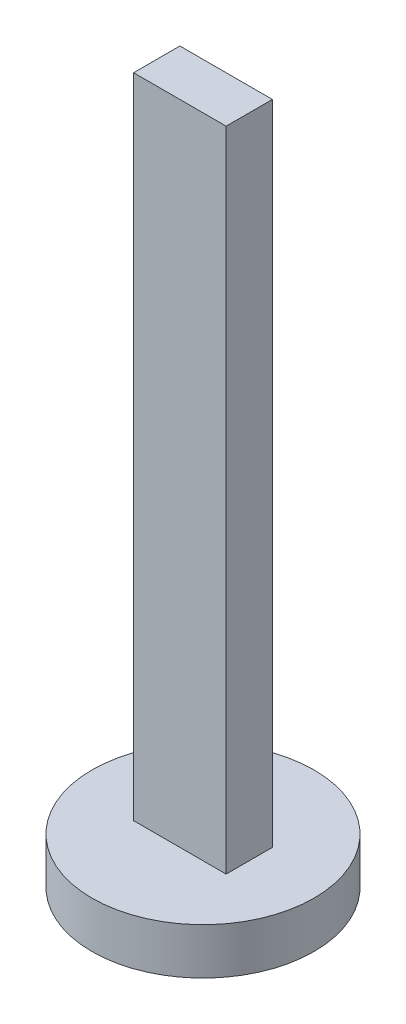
from build123d import *

# Parameters (mm, degrees)
SKETCH1_R           = 12
BOSS_EXTRUDE1_DEPTH = 5
SKETCH2_R           = 10.5
CUT_EXTRUDE1_DEPTH  = 2.5
SKETCH3_W           = 10
SKETCH3_H           = 5
BOSS_EXTRUDE2_DEPTH = 70


with BuildPart() as part:
    # Sketch1 → Boss-Extrude1 (new body)
    with BuildSketch(Plane(origin=(0, 0, 0), x_dir=(1, 0, 0), z_dir=(0, 1, 0))):
        with Locations(Location((0, 0, 0), (0, 0, 270))):
            Circle(SKETCH1_R)
    extrude(amount=BOSS_EXTRUDE1_DEPTH)

    # Sketch2 → Cut-Extrude1 (cut)
    with BuildSketch(Plane.XZ):
        with Locations(Location((0, 0, 0), (0, 0, 270))):
            Circle(SKETCH2_R)
    extrude(amount=-CUT_EXTRUDE1_DEPTH, mode=Mode.SUBTRACT)

    # Sketch3 → Boss-Extrude2 (add)
    with BuildSketch(Plane(origin=(0, 5, 0), x_dir=(1, 0, 0), z_dir=(0, 1, 0))):
        Rectangle(SKETCH3_W, SKETCH3_H)
    extrude(amount=BOSS_EXTRUDE2_DEPTH)


solid = part.part
